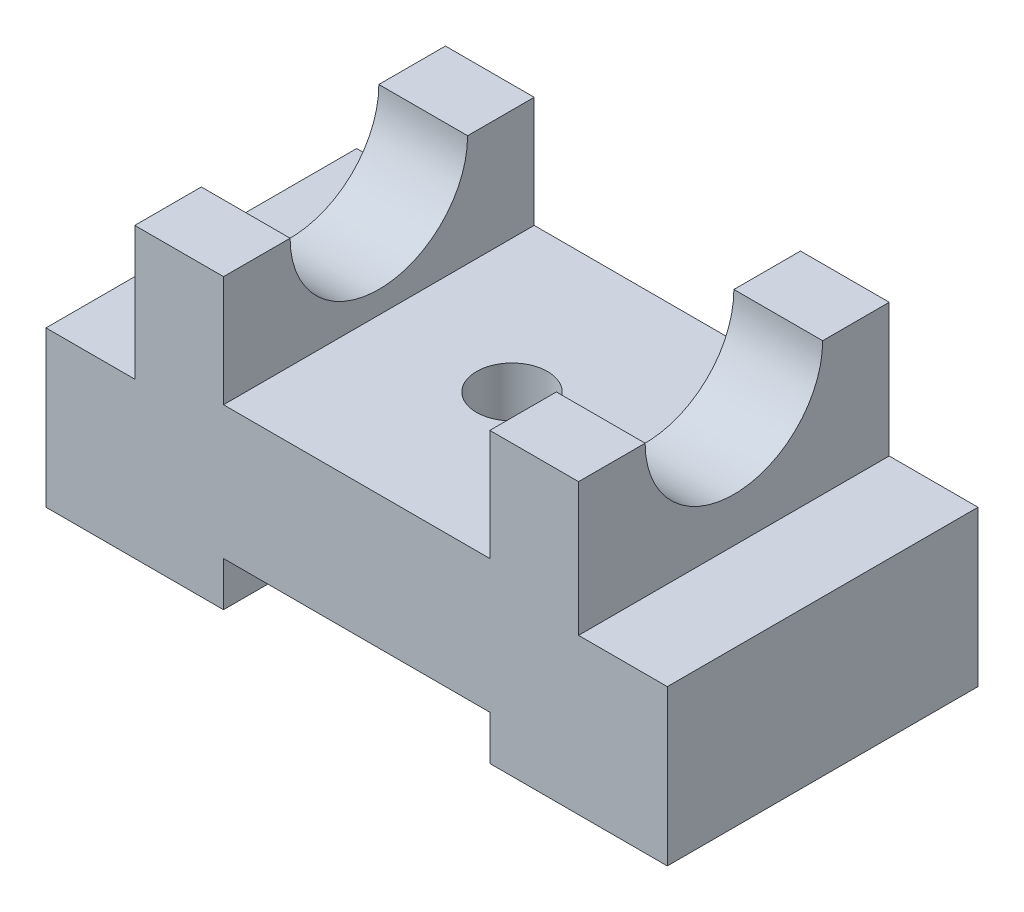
ISO-10303-21;
HEADER;
FILE_DESCRIPTION(('STEP AP214'),'2;1');
FILE_NAME('part.step','',(''),(''),'','','');
FILE_SCHEMA(('AUTOMOTIVE_DESIGN { 1 0 10303 214 1 1 1 1 }'));
ENDSEC;
DATA;
#1=APPLICATION_CONTEXT('core data for automotive mechanical design processes');
#2=APPLICATION_PROTOCOL_DEFINITION('international standard','automotive_design',2000,#1);
#3=PRODUCT_CONTEXT('',#1,'mechanical');
#4=PRODUCT('Part','Part','',(#3));
#5=PRODUCT_RELATED_PRODUCT_CATEGORY('part','',(#4));
#6=PRODUCT_DEFINITION_FORMATION('','',#4);
#7=PRODUCT_DEFINITION_CONTEXT('part definition',#1,'design');
#8=PRODUCT_DEFINITION('design','',#6,#7);
#9=PRODUCT_DEFINITION_SHAPE('','',#8);
#10=(LENGTH_UNIT() NAMED_UNIT(*) SI_UNIT(.MILLI.,.METRE.));
#11=(NAMED_UNIT(*) PLANE_ANGLE_UNIT() SI_UNIT($,.RADIAN.));
#12=(NAMED_UNIT(*) SI_UNIT($,.STERADIAN.) SOLID_ANGLE_UNIT());
#13=UNCERTAINTY_MEASURE_WITH_UNIT(LENGTH_MEASURE(1.E-05),#10,'distance_accuracy_value','');
#14=(GEOMETRIC_REPRESENTATION_CONTEXT(3) GLOBAL_UNCERTAINTY_ASSIGNED_CONTEXT((#13)) GLOBAL_UNIT_ASSIGNED_CONTEXT((#10,
#11,#12)) REPRESENTATION_CONTEXT('',''));
#15=CARTESIAN_POINT('',(0.,0.,0.));
#16=DIRECTION('',(0.,0.,1.));
#17=DIRECTION('',(1.,0.,0.));
#18=AXIS2_PLACEMENT_3D('',#15,#16,#17);
#19=CARTESIAN_POINT('',(-30.,25.,35.));
#20=DIRECTION('',(0.,-1.,0.));
#21=DIRECTION('',(1.,0.,0.));
#22=AXIS2_PLACEMENT_3D('',#19,#20,#21);
#23=PLANE('',#22);
#24=DIRECTION('',(0.,0.,-1.));
#25=VECTOR('',#24,1.);
#26=CARTESIAN_POINT('',(-50.,25.,35.));
#27=LINE('',#26,#25);
#28=CARTESIAN_POINT('',(-50.,25.,-20.));
#29=VERTEX_POINT('',#28);
#30=CARTESIAN_POINT('',(-50.,25.,-35.));
#31=VERTEX_POINT('',#30);
#32=EDGE_CURVE('E225',#29,#31,#27,.T.);
#33=ORIENTED_EDGE('',*,*,#32,.F.);
#34=DIRECTION('',(1.,0.,0.));
#35=VECTOR('',#34,1.);
#36=CARTESIAN_POINT('',(-70.,25.,-20.));
#37=LINE('',#36,#35);
#38=CARTESIAN_POINT('',(-30.,25.,-20.));
#39=VERTEX_POINT('',#38);
#40=EDGE_CURVE('E49',#29,#39,#37,.T.);
#41=ORIENTED_EDGE('',*,*,#40,.T.);
#42=DIRECTION('',(0.,0.,-1.));
#43=VECTOR('',#42,1.);
#44=CARTESIAN_POINT('',(-30.,25.,35.));
#45=LINE('',#44,#43);
#46=CARTESIAN_POINT('',(-30.,25.,-35.));
#47=VERTEX_POINT('',#46);
#48=EDGE_CURVE('E228',#39,#47,#45,.T.);
#49=ORIENTED_EDGE('',*,*,#48,.T.);
#50=DIRECTION('',(-1.,0.,0.));
#51=VECTOR('',#50,1.);
#52=CARTESIAN_POINT('',(-30.,25.,-35.));
#53=LINE('',#52,#51);
#54=EDGE_CURVE('E238',#47,#31,#53,.T.);
#55=ORIENTED_EDGE('',*,*,#54,.T.);
#56=EDGE_LOOP('',(#33,#41,#49,#55));
#57=FACE_BOUND('',#56,.T.);
#58=ADVANCED_FACE('F34',(#57),#23,.F.);
#59=CARTESIAN_POINT('',(30.,25.,35.));
#60=DIRECTION('',(0.,-1.,0.));
#61=DIRECTION('',(1.,0.,0.));
#62=AXIS2_PLACEMENT_3D('',#59,#60,#61);
#63=PLANE('',#62);
#64=DIRECTION('',(0.,0.,-1.));
#65=VECTOR('',#64,1.);
#66=CARTESIAN_POINT('',(30.,25.,35.));
#67=LINE('',#66,#65);
#68=CARTESIAN_POINT('',(30.,25.,-20.));
#69=VERTEX_POINT('',#68);
#70=CARTESIAN_POINT('',(30.,25.,-35.));
#71=VERTEX_POINT('',#70);
#72=EDGE_CURVE('E293',#69,#71,#67,.T.);
#73=ORIENTED_EDGE('',*,*,#72,.F.);
#74=DIRECTION('',(1.,0.,0.));
#75=VECTOR('',#74,1.);
#76=CARTESIAN_POINT('',(-70.,25.,-20.));
#77=LINE('',#76,#75);
#78=CARTESIAN_POINT('',(50.,25.,-20.));
#79=VERTEX_POINT('',#78);
#80=EDGE_CURVE('E57',#69,#79,#77,.T.);
#81=ORIENTED_EDGE('',*,*,#80,.T.);
#82=DIRECTION('',(0.,0.,-1.));
#83=VECTOR('',#82,1.);
#84=CARTESIAN_POINT('',(50.,25.,35.));
#85=LINE('',#84,#83);
#86=CARTESIAN_POINT('',(50.,25.,-35.));
#87=VERTEX_POINT('',#86);
#88=EDGE_CURVE('E185',#79,#87,#85,.T.);
#89=ORIENTED_EDGE('',*,*,#88,.T.);
#90=DIRECTION('',(-1.,0.,0.));
#91=VECTOR('',#90,1.);
#92=CARTESIAN_POINT('',(30.,25.,-35.));
#93=LINE('',#92,#91);
#94=EDGE_CURVE('E283',#87,#71,#93,.T.);
#95=ORIENTED_EDGE('',*,*,#94,.T.);
#96=EDGE_LOOP('',(#73,#81,#89,#95));
#97=FACE_BOUND('',#96,.T.);
#98=ADVANCED_FACE('F355',(#97),#63,.F.);
#99=CARTESIAN_POINT('',(-30.,0.,35.));
#100=DIRECTION('',(-1.,0.,0.));
#101=DIRECTION('',(0.,-1.,0.));
#102=AXIS2_PLACEMENT_3D('',#99,#100,#101);
#103=PLANE('',#102);
#104=ORIENTED_EDGE('',*,*,#48,.F.);
#105=CARTESIAN_POINT('',(-30.,25.,0.));
#106=DIRECTION('',(-1.,0.,0.));
#107=DIRECTION('',(0.,-1.,0.));
#108=AXIS2_PLACEMENT_3D('',#105,#106,#107);
#109=CIRCLE('',#108,20.);
#110=CARTESIAN_POINT('',(-30.,25.,20.));
#111=VERTEX_POINT('',#110);
#112=EDGE_CURVE('E255',#39,#111,#109,.T.);
#113=ORIENTED_EDGE('',*,*,#112,.T.);
#114=CARTESIAN_POINT('',(-30.,25.,35.));
#115=VERTEX_POINT('',#114);
#116=EDGE_CURVE('E42',#115,#111,#45,.T.);
#117=ORIENTED_EDGE('',*,*,#116,.F.);
#118=DIRECTION('',(0.,1.,0.));
#119=VECTOR('',#118,1.);
#120=CARTESIAN_POINT('',(-30.,0.,35.));
#121=LINE('',#120,#119);
#122=CARTESIAN_POINT('',(-30.,0.,35.));
#123=VERTEX_POINT('',#122);
#124=EDGE_CURVE('E290',#123,#115,#121,.T.);
#125=ORIENTED_EDGE('',*,*,#124,.F.);
#126=DIRECTION('',(0.,0.,-1.));
#127=VECTOR('',#126,1.);
#128=CARTESIAN_POINT('',(-30.,0.,35.));
#129=LINE('',#128,#127);
#130=CARTESIAN_POINT('',(-30.,0.,-35.));
#131=VERTEX_POINT('',#130);
#132=EDGE_CURVE('E254',#123,#131,#129,.T.);
#133=ORIENTED_EDGE('',*,*,#132,.T.);
#134=DIRECTION('',(0.,1.,0.));
#135=VECTOR('',#134,1.);
#136=CARTESIAN_POINT('',(-30.,0.,-35.));
#137=LINE('',#136,#135);
#138=EDGE_CURVE('E247',#131,#47,#137,.T.);
#139=ORIENTED_EDGE('',*,*,#138,.T.);
#140=EDGE_LOOP('',(#104,#113,#117,#125,#133,#139));
#141=FACE_BOUND('',#140,.T.);
#142=ADVANCED_FACE('F36',(#141),#103,.F.);
#143=ORIENTED_EDGE('',*,*,#116,.T.);
#144=DIRECTION('',(1.,0.,0.));
#145=VECTOR('',#144,1.);
#146=CARTESIAN_POINT('',(-70.,25.,20.));
#147=LINE('',#146,#145);
#148=CARTESIAN_POINT('',(-50.,25.,20.));
#149=VERTEX_POINT('',#148);
#150=EDGE_CURVE('E332',#111,#149,#147,.F.);
#151=ORIENTED_EDGE('',*,*,#150,.T.);
#152=CARTESIAN_POINT('',(-50.,25.,35.));
#153=VERTEX_POINT('',#152);
#154=EDGE_CURVE('E226',#153,#149,#27,.T.);
#155=ORIENTED_EDGE('',*,*,#154,.F.);
#156=DIRECTION('',(-1.,0.,0.));
#157=VECTOR('',#156,1.);
#158=CARTESIAN_POINT('',(-30.,25.,35.));
#159=LINE('',#158,#157);
#160=EDGE_CURVE('E327',#115,#153,#159,.T.);
#161=ORIENTED_EDGE('',*,*,#160,.F.);
#162=EDGE_LOOP('',(#143,#151,#155,#161));
#163=FACE_BOUND('',#162,.T.);
#164=ADVANCED_FACE('F405',(#163),#23,.F.);
#165=CARTESIAN_POINT('',(-50.,25.,35.));
#166=DIRECTION('',(1.,0.,0.));
#167=DIRECTION('',(0.,1.,0.));
#168=AXIS2_PLACEMENT_3D('',#165,#166,#167);
#169=PLANE('',#168);
#170=ORIENTED_EDGE('',*,*,#154,.T.);
#171=CARTESIAN_POINT('',(-50.,25.,0.));
#172=DIRECTION('',(1.,0.,0.));
#173=DIRECTION('',(0.,1.,0.));
#174=AXIS2_PLACEMENT_3D('',#171,#172,#173);
#175=CIRCLE('',#174,20.);
#176=EDGE_CURVE('E334',#149,#29,#175,.T.);
#177=ORIENTED_EDGE('',*,*,#176,.T.);
#178=ORIENTED_EDGE('',*,*,#32,.T.);
#179=DIRECTION('',(0.,-1.,0.));
#180=VECTOR('',#179,1.);
#181=CARTESIAN_POINT('',(-50.,25.,-35.));
#182=LINE('',#181,#180);
#183=CARTESIAN_POINT('',(-50.,-5.,-35.));
#184=VERTEX_POINT('',#183);
#185=EDGE_CURVE('E249',#31,#184,#182,.T.);
#186=ORIENTED_EDGE('',*,*,#185,.T.);
#187=DIRECTION('',(0.,0.,-1.));
#188=VECTOR('',#187,1.);
#189=CARTESIAN_POINT('',(-50.,-5.,35.));
#190=LINE('',#189,#188);
#191=CARTESIAN_POINT('',(-50.,-5.,35.));
#192=VERTEX_POINT('',#191);
#193=EDGE_CURVE('E222',#192,#184,#190,.T.);
#194=ORIENTED_EDGE('',*,*,#193,.F.);
#195=DIRECTION('',(0.,-1.,0.));
#196=VECTOR('',#195,1.);
#197=CARTESIAN_POINT('',(-50.,25.,35.));
#198=LINE('',#197,#196);
#199=EDGE_CURVE('E325',#153,#192,#198,.T.);
#200=ORIENTED_EDGE('',*,*,#199,.F.);
#201=EDGE_LOOP('',(#170,#177,#178,#186,#194,#200));
#202=FACE_BOUND('',#201,.T.);
#203=ADVANCED_FACE('F402',(#202),#169,.F.);
#204=CARTESIAN_POINT('',(-50.,-5.,35.));
#205=DIRECTION('',(0.,-1.,0.));
#206=DIRECTION('',(1.,0.,0.));
#207=AXIS2_PLACEMENT_3D('',#204,#205,#206);
#208=PLANE('',#207);
#209=DIRECTION('',(-1.,0.,0.));
#210=VECTOR('',#209,1.);
#211=CARTESIAN_POINT('',(-50.,-5.,-35.));
#212=LINE('',#211,#210);
#213=CARTESIAN_POINT('',(-70.,-5.,-35.));
#214=VERTEX_POINT('',#213);
#215=EDGE_CURVE('E263',#184,#214,#212,.T.);
#216=ORIENTED_EDGE('',*,*,#215,.T.);
#217=DIRECTION('',(0.,0.,-1.));
#218=VECTOR('',#217,1.);
#219=CARTESIAN_POINT('',(-70.,-5.,35.));
#220=LINE('',#219,#218);
#221=CARTESIAN_POINT('',(-70.,-5.,35.));
#222=VERTEX_POINT('',#221);
#223=EDGE_CURVE('E219',#222,#214,#220,.T.);
#224=ORIENTED_EDGE('',*,*,#223,.F.);
#225=DIRECTION('',(-1.,0.,0.));
#226=VECTOR('',#225,1.);
#227=CARTESIAN_POINT('',(-50.,-5.,35.));
#228=LINE('',#227,#226);
#229=EDGE_CURVE('E323',#192,#222,#228,.T.);
#230=ORIENTED_EDGE('',*,*,#229,.F.);
#231=ORIENTED_EDGE('',*,*,#193,.T.);
#232=EDGE_LOOP('',(#216,#224,#230,#231));
#233=FACE_BOUND('',#232,.T.);
#234=ADVANCED_FACE('F398',(#233),#208,.F.);
#235=CARTESIAN_POINT('',(-70.,-5.,35.));
#236=DIRECTION('',(1.,0.,0.));
#237=DIRECTION('',(0.,0.,-1.));
#238=AXIS2_PLACEMENT_3D('',#235,#236,#237);
#239=PLANE('',#238);
#240=DIRECTION('',(0.,-1.,0.));
#241=VECTOR('',#240,1.);
#242=CARTESIAN_POINT('',(-70.,-5.,-35.));
#243=LINE('',#242,#241);
#244=CARTESIAN_POINT('',(-70.,-40.,-35.));
#245=VERTEX_POINT('',#244);
#246=EDGE_CURVE('E265',#214,#245,#243,.T.);
#247=ORIENTED_EDGE('',*,*,#246,.T.);
#248=DIRECTION('',(0.,0.,-1.));
#249=VECTOR('',#248,1.);
#250=CARTESIAN_POINT('',(-70.,-40.,35.));
#251=LINE('',#250,#249);
#252=CARTESIAN_POINT('',(-70.,-40.,35.));
#253=VERTEX_POINT('',#252);
#254=EDGE_CURVE('E216',#253,#245,#251,.T.);
#255=ORIENTED_EDGE('',*,*,#254,.F.);
#256=DIRECTION('',(0.,-1.,0.));
#257=VECTOR('',#256,1.);
#258=CARTESIAN_POINT('',(-70.,-5.,35.));
#259=LINE('',#258,#257);
#260=EDGE_CURVE('E321',#222,#253,#259,.T.);
#261=ORIENTED_EDGE('',*,*,#260,.F.);
#262=ORIENTED_EDGE('',*,*,#223,.T.);
#263=EDGE_LOOP('',(#247,#255,#261,#262));
#264=FACE_BOUND('',#263,.T.);
#265=ADVANCED_FACE('F393',(#264),#239,.F.);
#266=CARTESIAN_POINT('',(-70.,-40.,35.));
#267=DIRECTION('',(0.,1.,0.));
#268=DIRECTION('',(0.,0.,1.));
#269=AXIS2_PLACEMENT_3D('',#266,#267,#268);
#270=PLANE('',#269);
#271=DIRECTION('',(1.,0.,0.));
#272=VECTOR('',#271,1.);
#273=CARTESIAN_POINT('',(-70.,-40.,-35.));
#274=LINE('',#273,#272);
#275=CARTESIAN_POINT('',(-30.,-40.,-35.));
#276=VERTEX_POINT('',#275);
#277=EDGE_CURVE('E267',#245,#276,#274,.T.);
#278=ORIENTED_EDGE('',*,*,#277,.T.);
#279=DIRECTION('',(0.,0.,-1.));
#280=VECTOR('',#279,1.);
#281=CARTESIAN_POINT('',(-30.,-40.,35.));
#282=LINE('',#281,#280);
#283=CARTESIAN_POINT('',(-30.,-40.,35.));
#284=VERTEX_POINT('',#283);
#285=EDGE_CURVE('E213',#284,#276,#282,.T.);
#286=ORIENTED_EDGE('',*,*,#285,.F.);
#287=DIRECTION('',(1.,0.,0.));
#288=VECTOR('',#287,1.);
#289=CARTESIAN_POINT('',(-70.,-40.,35.));
#290=LINE('',#289,#288);
#291=EDGE_CURVE('E319',#253,#284,#290,.T.);
#292=ORIENTED_EDGE('',*,*,#291,.F.);
#293=ORIENTED_EDGE('',*,*,#254,.T.);
#294=EDGE_LOOP('',(#278,#286,#292,#293));
#295=FACE_BOUND('',#294,.T.);
#296=ADVANCED_FACE('F389',(#295),#270,.F.);
#297=CARTESIAN_POINT('',(-30.,-30.,35.));
#298=DIRECTION('',(-1.,0.,0.));
#299=DIRECTION('',(0.,-1.,0.));
#300=AXIS2_PLACEMENT_3D('',#297,#298,#299);
#301=PLANE('',#300);
#302=DIRECTION('',(0.,1.,0.));
#303=VECTOR('',#302,1.);
#304=CARTESIAN_POINT('',(-30.,-30.,-35.));
#305=LINE('',#304,#303);
#306=CARTESIAN_POINT('',(-30.,-30.,-35.));
#307=VERTEX_POINT('',#306);
#308=EDGE_CURVE('E269',#276,#307,#305,.T.);
#309=ORIENTED_EDGE('',*,*,#308,.T.);
#310=DIRECTION('',(0.,0.,-1.));
#311=VECTOR('',#310,1.);
#312=CARTESIAN_POINT('',(-30.,-30.,35.));
#313=LINE('',#312,#311);
#314=CARTESIAN_POINT('',(-30.,-30.,35.));
#315=VERTEX_POINT('',#314);
#316=EDGE_CURVE('E210',#315,#307,#313,.T.);
#317=ORIENTED_EDGE('',*,*,#316,.F.);
#318=DIRECTION('',(0.,1.,0.));
#319=VECTOR('',#318,1.);
#320=CARTESIAN_POINT('',(-30.,-30.,35.));
#321=LINE('',#320,#319);
#322=EDGE_CURVE('E317',#284,#315,#321,.T.);
#323=ORIENTED_EDGE('',*,*,#322,.F.);
#324=ORIENTED_EDGE('',*,*,#285,.T.);
#325=EDGE_LOOP('',(#309,#317,#323,#324));
#326=FACE_BOUND('',#325,.T.);
#327=ADVANCED_FACE('F385',(#326),#301,.F.);
#328=CARTESIAN_POINT('',(30.,-30.,35.));
#329=DIRECTION('',(0.,1.,0.));
#330=DIRECTION('',(0.,0.,1.));
#331=AXIS2_PLACEMENT_3D('',#328,#329,#330);
#332=PLANE('',#331);
#333=CARTESIAN_POINT('',(0.,-30.,0.));
#334=DIRECTION('',(0.,1.,0.));
#335=DIRECTION('',(0.,0.,1.));
#336=AXIS2_PLACEMENT_3D('',#333,#334,#335);
#337=CIRCLE('',#336,8.);
#338=CARTESIAN_POINT('',(0.,-30.,8.));
#339=VERTEX_POINT('',#338);
#340=EDGE_CURVE('E186',#339,#339,#337,.T.);
#341=ORIENTED_EDGE('',*,*,#340,.T.);
#342=EDGE_LOOP('',(#341));
#343=FACE_BOUND('',#342,.T.);
#344=DIRECTION('',(1.,0.,0.));
#345=VECTOR('',#344,1.);
#346=CARTESIAN_POINT('',(30.,-30.,-35.));
#347=LINE('',#346,#345);
#348=CARTESIAN_POINT('',(30.,-30.,-35.));
#349=VERTEX_POINT('',#348);
#350=EDGE_CURVE('E271',#307,#349,#347,.T.);
#351=ORIENTED_EDGE('',*,*,#350,.T.);
#352=DIRECTION('',(0.,0.,-1.));
#353=VECTOR('',#352,1.);
#354=CARTESIAN_POINT('',(30.,-30.,35.));
#355=LINE('',#354,#353);
#356=CARTESIAN_POINT('',(30.,-30.,35.));
#357=VERTEX_POINT('',#356);
#358=EDGE_CURVE('E207',#357,#349,#355,.T.);
#359=ORIENTED_EDGE('',*,*,#358,.F.);
#360=DIRECTION('',(1.,0.,0.));
#361=VECTOR('',#360,1.);
#362=CARTESIAN_POINT('',(30.,-30.,35.));
#363=LINE('',#362,#361);
#364=EDGE_CURVE('E315',#315,#357,#363,.T.);
#365=ORIENTED_EDGE('',*,*,#364,.F.);
#366=ORIENTED_EDGE('',*,*,#316,.T.);
#367=EDGE_LOOP('',(#351,#359,#365,#366));
#368=FACE_BOUND('',#367,.T.);
#369=ADVANCED_FACE('F380',(#343,#368),#332,.F.);
#370=CARTESIAN_POINT('',(30.,-40.,35.));
#371=DIRECTION('',(1.,0.,0.));
#372=DIRECTION('',(0.,1.,0.));
#373=AXIS2_PLACEMENT_3D('',#370,#371,#372);
#374=PLANE('',#373);
#375=DIRECTION('',(0.,-1.,0.));
#376=VECTOR('',#375,1.);
#377=CARTESIAN_POINT('',(30.,-40.,-35.));
#378=LINE('',#377,#376);
#379=CARTESIAN_POINT('',(30.,-40.,-35.));
#380=VERTEX_POINT('',#379);
#381=EDGE_CURVE('E273',#349,#380,#378,.T.);
#382=ORIENTED_EDGE('',*,*,#381,.T.);
#383=DIRECTION('',(0.,0.,-1.));
#384=VECTOR('',#383,1.);
#385=CARTESIAN_POINT('',(30.,-40.,35.));
#386=LINE('',#385,#384);
#387=CARTESIAN_POINT('',(30.,-40.,35.));
#388=VERTEX_POINT('',#387);
#389=EDGE_CURVE('E204',#388,#380,#386,.T.);
#390=ORIENTED_EDGE('',*,*,#389,.F.);
#391=DIRECTION('',(0.,-1.,0.));
#392=VECTOR('',#391,1.);
#393=CARTESIAN_POINT('',(30.,-40.,35.));
#394=LINE('',#393,#392);
#395=EDGE_CURVE('E313',#357,#388,#394,.T.);
#396=ORIENTED_EDGE('',*,*,#395,.F.);
#397=ORIENTED_EDGE('',*,*,#358,.T.);
#398=EDGE_LOOP('',(#382,#390,#396,#397));
#399=FACE_BOUND('',#398,.T.);
#400=ADVANCED_FACE('F374',(#399),#374,.F.);
#401=CARTESIAN_POINT('',(70.,-40.,35.));
#402=DIRECTION('',(0.,1.,0.));
#403=DIRECTION('',(0.,0.,1.));
#404=AXIS2_PLACEMENT_3D('',#401,#402,#403);
#405=PLANE('',#404);
#406=DIRECTION('',(1.,0.,0.));
#407=VECTOR('',#406,1.);
#408=CARTESIAN_POINT('',(70.,-40.,-35.));
#409=LINE('',#408,#407);
#410=CARTESIAN_POINT('',(70.,-40.,-35.));
#411=VERTEX_POINT('',#410);
#412=EDGE_CURVE('E275',#380,#411,#409,.T.);
#413=ORIENTED_EDGE('',*,*,#412,.T.);
#414=DIRECTION('',(0.,0.,-1.));
#415=VECTOR('',#414,1.);
#416=CARTESIAN_POINT('',(70.,-40.,35.));
#417=LINE('',#416,#415);
#418=CARTESIAN_POINT('',(70.,-40.,35.));
#419=VERTEX_POINT('',#418);
#420=EDGE_CURVE('E201',#419,#411,#417,.T.);
#421=ORIENTED_EDGE('',*,*,#420,.F.);
#422=DIRECTION('',(1.,0.,0.));
#423=VECTOR('',#422,1.);
#424=CARTESIAN_POINT('',(70.,-40.,35.));
#425=LINE('',#424,#423);
#426=EDGE_CURVE('E311',#388,#419,#425,.T.);
#427=ORIENTED_EDGE('',*,*,#426,.F.);
#428=ORIENTED_EDGE('',*,*,#389,.T.);
#429=EDGE_LOOP('',(#413,#421,#427,#428));
#430=FACE_BOUND('',#429,.T.);
#431=ADVANCED_FACE('F370',(#430),#405,.F.);
#432=CARTESIAN_POINT('',(70.,-4.99999999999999,35.));
#433=DIRECTION('',(-1.,0.,0.));
#434=DIRECTION('',(0.,0.,1.));
#435=AXIS2_PLACEMENT_3D('',#432,#433,#434);
#436=PLANE('',#435);
#437=DIRECTION('',(0.,1.,0.));
#438=VECTOR('',#437,1.);
#439=CARTESIAN_POINT('',(70.,-4.99999999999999,-35.));
#440=LINE('',#439,#438);
#441=CARTESIAN_POINT('',(70.,-4.99999999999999,-35.));
#442=VERTEX_POINT('',#441);
#443=EDGE_CURVE('E277',#411,#442,#440,.T.);
#444=ORIENTED_EDGE('',*,*,#443,.T.);
#445=DIRECTION('',(0.,0.,-1.));
#446=VECTOR('',#445,1.);
#447=CARTESIAN_POINT('',(70.,-4.99999999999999,35.));
#448=LINE('',#447,#446);
#449=CARTESIAN_POINT('',(70.,-4.99999999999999,35.));
#450=VERTEX_POINT('',#449);
#451=EDGE_CURVE('E193',#450,#442,#448,.T.);
#452=ORIENTED_EDGE('',*,*,#451,.F.);
#453=DIRECTION('',(0.,1.,0.));
#454=VECTOR('',#453,1.);
#455=CARTESIAN_POINT('',(70.,-4.99999999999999,35.));
#456=LINE('',#455,#454);
#457=EDGE_CURVE('E309',#419,#450,#456,.T.);
#458=ORIENTED_EDGE('',*,*,#457,.F.);
#459=ORIENTED_EDGE('',*,*,#420,.T.);
#460=EDGE_LOOP('',(#444,#452,#458,#459));
#461=FACE_BOUND('',#460,.T.);
#462=ADVANCED_FACE('F365',(#461),#436,.F.);
#463=CARTESIAN_POINT('',(50.,-4.99999999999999,35.));
#464=DIRECTION('',(0.,-1.,0.));
#465=DIRECTION('',(0.,0.,-1.));
#466=AXIS2_PLACEMENT_3D('',#463,#464,#465);
#467=PLANE('',#466);
#468=DIRECTION('',(-1.,0.,0.));
#469=VECTOR('',#468,1.);
#470=CARTESIAN_POINT('',(50.,-4.99999999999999,-35.));
#471=LINE('',#470,#469);
#472=CARTESIAN_POINT('',(50.,-4.99999999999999,-35.));
#473=VERTEX_POINT('',#472);
#474=EDGE_CURVE('E279',#442,#473,#471,.T.);
#475=ORIENTED_EDGE('',*,*,#474,.T.);
#476=DIRECTION('',(0.,0.,-1.));
#477=VECTOR('',#476,1.);
#478=CARTESIAN_POINT('',(50.,-4.99999999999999,35.));
#479=LINE('',#478,#477);
#480=CARTESIAN_POINT('',(50.,-4.99999999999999,35.));
#481=VERTEX_POINT('',#480);
#482=EDGE_CURVE('E190',#481,#473,#479,.T.);
#483=ORIENTED_EDGE('',*,*,#482,.F.);
#484=DIRECTION('',(-1.,0.,0.));
#485=VECTOR('',#484,1.);
#486=CARTESIAN_POINT('',(50.,-4.99999999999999,35.));
#487=LINE('',#486,#485);
#488=EDGE_CURVE('E307',#450,#481,#487,.T.);
#489=ORIENTED_EDGE('',*,*,#488,.F.);
#490=ORIENTED_EDGE('',*,*,#451,.T.);
#491=EDGE_LOOP('',(#475,#483,#489,#490));
#492=FACE_BOUND('',#491,.T.);
#493=ADVANCED_FACE('F359',(#492),#467,.F.);
#494=CARTESIAN_POINT('',(50.,25.,35.));
#495=DIRECTION('',(-1.,0.,0.));
#496=DIRECTION('',(0.,-1.,0.));
#497=AXIS2_PLACEMENT_3D('',#494,#495,#496);
#498=PLANE('',#497);
#499=ORIENTED_EDGE('',*,*,#88,.F.);
#500=CARTESIAN_POINT('',(50.,25.,0.));
#501=DIRECTION('',(1.,0.,0.));
#502=DIRECTION('',(0.,1.,0.));
#503=AXIS2_PLACEMENT_3D('',#500,#501,#502);
#504=CIRCLE('',#503,20.);
#505=CARTESIAN_POINT('',(50.,25.,20.));
#506=VERTEX_POINT('',#505);
#507=EDGE_CURVE('E171',#506,#79,#504,.T.);
#508=ORIENTED_EDGE('',*,*,#507,.F.);
#509=CARTESIAN_POINT('',(50.,25.,35.));
#510=VERTEX_POINT('',#509);
#511=EDGE_CURVE('E182',#510,#506,#85,.T.);
#512=ORIENTED_EDGE('',*,*,#511,.F.);
#513=DIRECTION('',(0.,1.,0.));
#514=VECTOR('',#513,1.);
#515=CARTESIAN_POINT('',(50.,25.,35.));
#516=LINE('',#515,#514);
#517=EDGE_CURVE('E303',#481,#510,#516,.T.);
#518=ORIENTED_EDGE('',*,*,#517,.F.);
#519=ORIENTED_EDGE('',*,*,#482,.T.);
#520=DIRECTION('',(0.,1.,0.));
#521=VECTOR('',#520,1.);
#522=CARTESIAN_POINT('',(50.,25.,-35.));
#523=LINE('',#522,#521);
#524=EDGE_CURVE('E281',#473,#87,#523,.T.);
#525=ORIENTED_EDGE('',*,*,#524,.T.);
#526=EDGE_LOOP('',(#499,#508,#512,#518,#519,#525));
#527=FACE_BOUND('',#526,.T.);
#528=ADVANCED_FACE('F180',(#527),#498,.F.);
#529=ORIENTED_EDGE('',*,*,#511,.T.);
#530=DIRECTION('',(1.,0.,0.));
#531=VECTOR('',#530,1.);
#532=CARTESIAN_POINT('',(-70.,25.,20.));
#533=LINE('',#532,#531);
#534=CARTESIAN_POINT('',(30.,25.,20.));
#535=VERTEX_POINT('',#534);
#536=EDGE_CURVE('E168',#506,#535,#533,.F.);
#537=ORIENTED_EDGE('',*,*,#536,.T.);
#538=CARTESIAN_POINT('',(30.,25.,35.));
#539=VERTEX_POINT('',#538);
#540=EDGE_CURVE('E195',#539,#535,#67,.T.);
#541=ORIENTED_EDGE('',*,*,#540,.F.);
#542=DIRECTION('',(-1.,0.,0.));
#543=VECTOR('',#542,1.);
#544=CARTESIAN_POINT('',(30.,25.,35.));
#545=LINE('',#544,#543);
#546=EDGE_CURVE('E189',#510,#539,#545,.T.);
#547=ORIENTED_EDGE('',*,*,#546,.F.);
#548=EDGE_LOOP('',(#529,#537,#541,#547));
#549=FACE_BOUND('',#548,.T.);
#550=ADVANCED_FACE('F188',(#549),#63,.F.);
#551=CARTESIAN_POINT('',(30.,0.,35.));
#552=DIRECTION('',(1.,0.,0.));
#553=DIRECTION('',(0.,1.,0.));
#554=AXIS2_PLACEMENT_3D('',#551,#552,#553);
#555=PLANE('',#554);
#556=ORIENTED_EDGE('',*,*,#540,.T.);
#557=CARTESIAN_POINT('',(30.,25.,0.));
#558=DIRECTION('',(1.,0.,0.));
#559=DIRECTION('',(0.,1.,0.));
#560=AXIS2_PLACEMENT_3D('',#557,#558,#559);
#561=CIRCLE('',#560,20.);
#562=EDGE_CURVE('E11',#535,#69,#561,.T.);
#563=ORIENTED_EDGE('',*,*,#562,.T.);
#564=ORIENTED_EDGE('',*,*,#72,.T.);
#565=DIRECTION('',(0.,-1.,0.));
#566=VECTOR('',#565,1.);
#567=CARTESIAN_POINT('',(30.,0.,-35.));
#568=LINE('',#567,#566);
#569=CARTESIAN_POINT('',(30.,0.,-35.));
#570=VERTEX_POINT('',#569);
#571=EDGE_CURVE('E286',#71,#570,#568,.T.);
#572=ORIENTED_EDGE('',*,*,#571,.T.);
#573=DIRECTION('',(0.,0.,-1.));
#574=VECTOR('',#573,1.);
#575=CARTESIAN_POINT('',(30.,0.,35.));
#576=LINE('',#575,#574);
#577=CARTESIAN_POINT('',(30.,0.,35.));
#578=VERTEX_POINT('',#577);
#579=EDGE_CURVE('E291',#578,#570,#576,.T.);
#580=ORIENTED_EDGE('',*,*,#579,.F.);
#581=DIRECTION('',(0.,-1.,0.));
#582=VECTOR('',#581,1.);
#583=CARTESIAN_POINT('',(30.,0.,35.));
#584=LINE('',#583,#582);
#585=EDGE_CURVE('E301',#539,#578,#584,.T.);
#586=ORIENTED_EDGE('',*,*,#585,.F.);
#587=EDGE_LOOP('',(#556,#563,#564,#572,#580,#586));
#588=FACE_BOUND('',#587,.T.);
#589=ADVANCED_FACE('F300',(#588),#555,.F.);
#590=CARTESIAN_POINT('',(-30.,0.,35.));
#591=DIRECTION('',(0.,-1.,0.));
#592=DIRECTION('',(0.,0.,-1.));
#593=AXIS2_PLACEMENT_3D('',#590,#591,#592);
#594=PLANE('',#593);
#595=CARTESIAN_POINT('',(0.,0.,0.));
#596=DIRECTION('',(0.,1.,0.));
#597=DIRECTION('',(0.,0.,1.));
#598=AXIS2_PLACEMENT_3D('',#595,#596,#597);
#599=CIRCLE('',#598,8.);
#600=CARTESIAN_POINT('',(0.,0.,8.));
#601=VERTEX_POINT('',#600);
#602=EDGE_CURVE('E339',#601,#601,#599,.T.);
#603=ORIENTED_EDGE('',*,*,#602,.F.);
#604=EDGE_LOOP('',(#603));
#605=FACE_BOUND('',#604,.T.);
#606=DIRECTION('',(-1.,0.,0.));
#607=VECTOR('',#606,1.);
#608=CARTESIAN_POINT('',(-30.,0.,-35.));
#609=LINE('',#608,#607);
#610=EDGE_CURVE('E288',#570,#131,#609,.T.);
#611=ORIENTED_EDGE('',*,*,#610,.T.);
#612=ORIENTED_EDGE('',*,*,#132,.F.);
#613=DIRECTION('',(-1.,0.,0.));
#614=VECTOR('',#613,1.);
#615=CARTESIAN_POINT('',(-30.,0.,35.));
#616=LINE('',#615,#614);
#617=EDGE_CURVE('E259',#578,#123,#616,.T.);
#618=ORIENTED_EDGE('',*,*,#617,.F.);
#619=ORIENTED_EDGE('',*,*,#579,.T.);
#620=EDGE_LOOP('',(#611,#612,#618,#619));
#621=FACE_BOUND('',#620,.T.);
#622=ADVANCED_FACE('F346',(#605,#621),#594,.F.);
#623=CARTESIAN_POINT('',(0.,0.,35.));
#624=DIRECTION('',(0.,0.,1.));
#625=DIRECTION('',(1.,0.,0.));
#626=AXIS2_PLACEMENT_3D('',#623,#624,#625);
#627=PLANE('',#626);
#628=ORIENTED_EDGE('',*,*,#124,.T.);
#629=ORIENTED_EDGE('',*,*,#160,.T.);
#630=ORIENTED_EDGE('',*,*,#199,.T.);
#631=ORIENTED_EDGE('',*,*,#229,.T.);
#632=ORIENTED_EDGE('',*,*,#260,.T.);
#633=ORIENTED_EDGE('',*,*,#291,.T.);
#634=ORIENTED_EDGE('',*,*,#322,.T.);
#635=ORIENTED_EDGE('',*,*,#364,.T.);
#636=ORIENTED_EDGE('',*,*,#395,.T.);
#637=ORIENTED_EDGE('',*,*,#426,.T.);
#638=ORIENTED_EDGE('',*,*,#457,.T.);
#639=ORIENTED_EDGE('',*,*,#488,.T.);
#640=ORIENTED_EDGE('',*,*,#517,.T.);
#641=ORIENTED_EDGE('',*,*,#546,.T.);
#642=ORIENTED_EDGE('',*,*,#585,.T.);
#643=ORIENTED_EDGE('',*,*,#617,.T.);
#644=EDGE_LOOP('',(#628,#629,#630,#631,#632,#633,#634,#635,#636,#637,#638,#639,#640,#641,#642,#643));
#645=FACE_BOUND('',#644,.T.);
#646=ADVANCED_FACE('F348',(#645),#627,.T.);
#647=CARTESIAN_POINT('',(0.,0.,-35.));
#648=DIRECTION('',(0.,0.,1.));
#649=DIRECTION('',(1.,0.,0.));
#650=AXIS2_PLACEMENT_3D('',#647,#648,#649);
#651=PLANE('',#650);
#652=ORIENTED_EDGE('',*,*,#138,.F.);
#653=ORIENTED_EDGE('',*,*,#610,.F.);
#654=ORIENTED_EDGE('',*,*,#571,.F.);
#655=ORIENTED_EDGE('',*,*,#94,.F.);
#656=ORIENTED_EDGE('',*,*,#524,.F.);
#657=ORIENTED_EDGE('',*,*,#474,.F.);
#658=ORIENTED_EDGE('',*,*,#443,.F.);
#659=ORIENTED_EDGE('',*,*,#412,.F.);
#660=ORIENTED_EDGE('',*,*,#381,.F.);
#661=ORIENTED_EDGE('',*,*,#350,.F.);
#662=ORIENTED_EDGE('',*,*,#308,.F.);
#663=ORIENTED_EDGE('',*,*,#277,.F.);
#664=ORIENTED_EDGE('',*,*,#246,.F.);
#665=ORIENTED_EDGE('',*,*,#215,.F.);
#666=ORIENTED_EDGE('',*,*,#185,.F.);
#667=ORIENTED_EDGE('',*,*,#54,.F.);
#668=EDGE_LOOP('',(#652,#653,#654,#655,#656,#657,#658,#659,#660,#661,#662,#663,#664,#665,#666,#667));
#669=FACE_BOUND('',#668,.T.);
#670=ADVANCED_FACE('F245',(#669),#651,.F.);
#671=CARTESIAN_POINT('',(-70.,25.,0.));
#672=DIRECTION('',(1.,0.,0.));
#673=DIRECTION('',(0.,1.,0.));
#674=AXIS2_PLACEMENT_3D('',#671,#672,#673);
#675=CYLINDRICAL_SURFACE('',#674,20.);
#676=ORIENTED_EDGE('',*,*,#562,.F.);
#677=ORIENTED_EDGE('',*,*,#536,.F.);
#678=ORIENTED_EDGE('',*,*,#507,.T.);
#679=ORIENTED_EDGE('',*,*,#80,.F.);
#680=EDGE_LOOP('',(#676,#677,#678,#679));
#681=FACE_BOUND('',#680,.T.);
#682=ADVANCED_FACE('F170',(#681),#675,.F.);
#683=ORIENTED_EDGE('',*,*,#40,.F.);
#684=ORIENTED_EDGE('',*,*,#176,.F.);
#685=ORIENTED_EDGE('',*,*,#150,.F.);
#686=ORIENTED_EDGE('',*,*,#112,.F.);
#687=EDGE_LOOP('',(#683,#684,#685,#686));
#688=FACE_BOUND('',#687,.T.);
#689=ADVANCED_FACE('F404',(#688),#675,.F.);
#690=CARTESIAN_POINT('',(0.,-40.,0.));
#691=DIRECTION('',(0.,1.,0.));
#692=DIRECTION('',(0.,0.,1.));
#693=AXIS2_PLACEMENT_3D('',#690,#691,#692);
#694=CYLINDRICAL_SURFACE('',#693,8.);
#695=ORIENTED_EDGE('',*,*,#602,.T.);
#696=EDGE_LOOP('',(#695));
#697=FACE_BOUND('',#696,.T.);
#698=ORIENTED_EDGE('',*,*,#340,.F.);
#699=EDGE_LOOP('',(#698));
#700=FACE_BOUND('',#699,.T.);
#701=ADVANCED_FACE('F343',(#697,#700),#694,.F.);
#702=CLOSED_SHELL('',(#58,#98,#142,#164,#203,#234,#265,#296,#327,#369,#400,#431,#462,#493,#528,
#550,#589,#622,#646,#670,#682,#689,#701));
#703=MANIFOLD_SOLID_BREP('B2',#702);
#704=ADVANCED_BREP_SHAPE_REPRESENTATION('',(#18,#703),#14);
#705=SHAPE_DEFINITION_REPRESENTATION(#9,#704);
ENDSEC;
END-ISO-10303-21;
